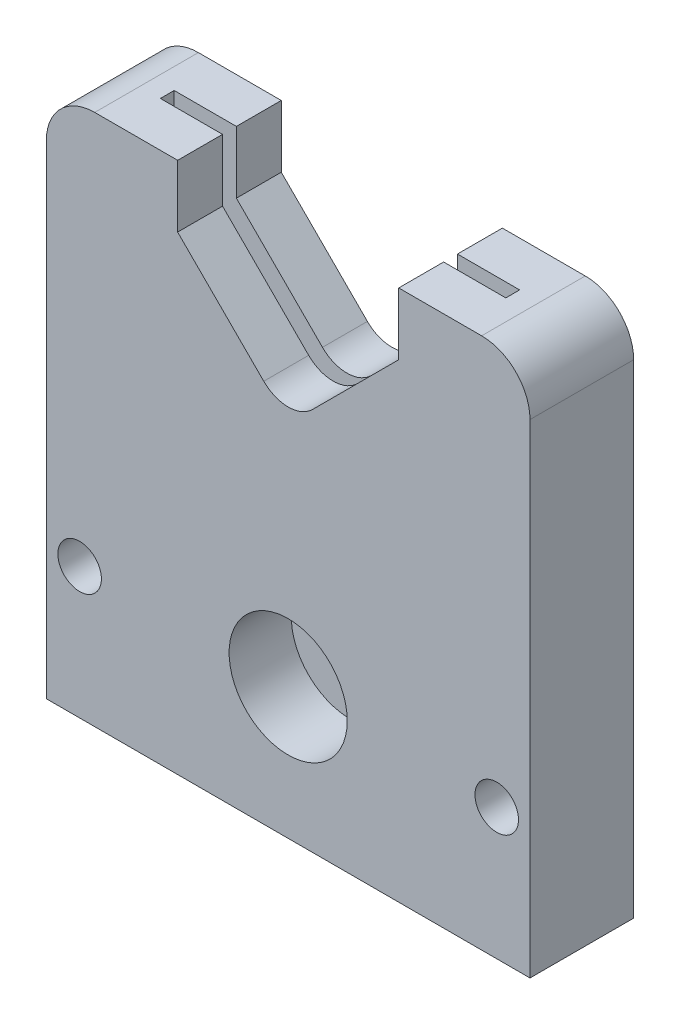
from build123d import *

# Parameters (mm, degrees)
SKETCH2_W               = 70
SKETCH2_H               = 70
BOSS_EXTRUDE1_DEPTH     = 15
FILLET1_R               = 7
FILLET2_R               = 7
CUT_EXTRUDE3_DEPTH      = 101.124921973
CUT_EXTRUDE3_DEPTH_BACK = 101.124921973
SKETCH4_R               = 3.15
CUT_EXTRUDE11_DEPTH     = 20
SKETCH20_R              = 8.55
CUT_EXTRUDE12_DEPTH     = 9
SKETCH21_W              = 70
SKETCH21_H              = 15
BOSS_EXTRUDE4_DEPTH     = 7
SKETCH25_W              = 50
SKETCH25_H              = 2
CUT_EXTRUDE14_DEPTH     = 25


with BuildPart() as part:
    # Sketch2 → Boss-Extrude1 (new body)
    with BuildSketch(Plane.XY):
        with Locations((35, 35)):
            Rectangle(SKETCH2_W, SKETCH2_H)
    extrude(amount=BOSS_EXTRUDE1_DEPTH)

    # Fillet1
    fillet1_edges = [part.edges().sort_by_distance(p)[0] for p in [
        (70, 70, 7.5),
    ]]
    fillet(fillet1_edges, radius=FILLET1_R)

    # Fillet2
    fillet2_edges = [part.edges().sort_by_distance(p)[0] for p in [
        (0, 70, 7.5),
    ]]
    fillet(fillet2_edges, radius=FILLET2_R)

    # Sketch6 → Cut-Extrude3 (cut, two sides: drawn at the far end of the back side and taken through both)
    with BuildSketch(Plane.XY.offset(15).offset(-CUT_EXTRUDE3_DEPTH_BACK)):
        with BuildLine():
            Line((19, 253.216627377), (19, 70))
            Line((19, 70), (19, 61))
            Line((19, 61), (31.464466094, 48.535533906))
            ThreePointArc((31.464466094, 48.535533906), (35, 47.071067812), (38.535533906, 48.535533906))
            Line((38.535533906, 48.535533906), (51, 61))
            Line((51, 61), (51, 70))
            Line((51, 70), (51, 253.216627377))
            Line((51, 253.216627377), (51, 619.649882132))
            Line((51, 619.649882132), (19, 619.649882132))
            Line((19, 619.649882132), (19, 253.216627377))
        make_face()
    extrude(amount=CUT_EXTRUDE3_DEPTH + CUT_EXTRUDE3_DEPTH_BACK, mode=Mode.SUBTRACT)

    # Sketch4 → Cut-Extrude11 (cut)
    with BuildSketch(Plane.XY.offset(15)):
        with Locations((4.815, 12)):
            Circle(SKETCH4_R)
        with Locations((65.185, 12)):
            Circle(SKETCH4_R)
    extrude(amount=-CUT_EXTRUDE11_DEPTH, mode=Mode.SUBTRACT)

    # Sketch20 → Cut-Extrude12 (cut)
    with BuildSketch(Plane.XY.offset(15)):
        with Locations((35, 12)):
            Circle(SKETCH20_R)
    extrude(amount=-CUT_EXTRUDE12_DEPTH, mode=Mode.SUBTRACT)

    # Sketch21 → Boss-Extrude4 (add)
    with BuildSketch(Plane.XZ):
        with Locations((35, 7.5)):
            Rectangle(SKETCH21_W, SKETCH21_H)
    extrude(amount=BOSS_EXTRUDE4_DEPTH)

    # Sketch25 → Cut-Extrude14 (cut)
    with BuildSketch(Plane(origin=(0, 70, 0), x_dir=(1, 0, 0), z_dir=(0, 1, 0))):
        with Locations((35, -7.5)):
            Rectangle(SKETCH25_W, SKETCH25_H)
    extrude(amount=-CUT_EXTRUDE14_DEPTH, mode=Mode.SUBTRACT)


solid = part.part
